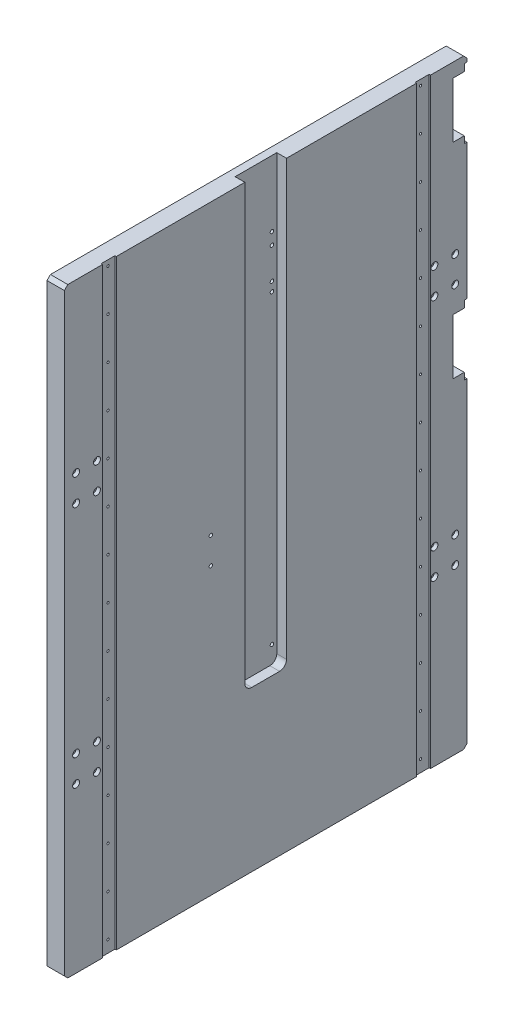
from build123d import *

# Parameters (mm, degrees)
ESQUISSE1_W                                        = 580
ESQUISSE1_H                                        = 865
BOSS_EXTRU_1_DEPTH                                 = 25
ENL_V_MAT_EXTRU_1_DEPTH                            = 14
TROU_TARAUD_M61_D                                  = 5
ESQUISSE17_W                                       = 20
ESQUISSE17_H                                       = 865
ENL_V_MAT_EXTRU_6_DEPTH                            = 2
CHAMBRAGE_POUR_VIS_T_TE_HEXAGONALE_M51_D           = 5.5
CHAMBRAGE_POUR_VIS_T_TE_HEXAGONALE_M51_CBORE_D     = 10
CHAMBRAGE_POUR_VIS_T_TE_HEXAGONALE_M51_CBORE_DEPTH = 5.4
R_P_TITION_LIN_AIRE1_COUNT                         = 2
R_P_TITION_LIN_AIRE1_PITCH                         = 350
TROU_TARAUD_M44_AT_2_COUNT                         = 2
TROU_TARAUD_M44_AT_2_PITCH                         = 450
R_P_TITION_LIN_AIRE2_COUNT                         = 15
R_P_TITION_LIN_AIRE2_PITCH                         = 60
TROU_TARAUD_M62_D                                  = 5
ENL_V_MAT_EXTRU_7_DEPTH                            = 30
TROU_TARAUD_M31_AT_2_COUNT                         = 2
TROU_TARAUD_M31_AT_2_PITCH                         = 35
TROU_TARAUD_M31_AT_3_COUNT                         = 2
TROU_TARAUD_M31_AT_3_PITCH                         = 5
TROU_TARAUD_M31_AT_4_COUNT                         = 2
TROU_TARAUD_M31_AT_4_PITCH                         = 10
TROU_TARAUD_M31_AT_5_COUNT                         = 2
TROU_TARAUD_M31_AT_5_PITCH                         = 40
TROU_TARAUD_M31_AT_6_COUNT                         = 2
TROU_TARAUD_M31_AT_6_PITCH                         = 5
TROU_TARAUD_M31_AT_7_COUNT                         = 2
TROU_TARAUD_M31_AT_7_PITCH                         = 50
TROU_TARAUD_M31_AT_8_COUNT                         = 2
TROU_TARAUD_M31_AT_8_PITCH                         = 45
TROU_TARAUD_M32_AT_2_COUNT                         = 2
TROU_TARAUD_M32_AT_2_PITCH                         = 90
R_P_TITION_LIN_AIRE3_COUNT                         = 2
R_P_TITION_LIN_AIRE3_PITCH                         = 295
CHANFREIN1_SIZE                                    = 5


with BuildPart() as part:
    # Esquisse1 → Boss.-Extru.1 (new body)
    with BuildSketch(Plane(origin=(0, 0, 0), x_dir=(0, 0, -1), z_dir=(1, 0, 0))):
        with Locations((0, 97.5)):
            Rectangle(ESQUISSE1_W, ESQUISSE1_H)
    extrude(amount=-BOSS_EXTRU_1_DEPTH)

    # Esquisse2 → Enl_v. mat.-Extru.1 (cut)
    with BuildSketch(Plane(origin=(0, 0, 0), x_dir=(0, 0, -1), z_dir=(1, 0, 0))):
        with BuildLine():
            Line((-30, 530), (-30, -95))
            ThreePointArc((-30, -95), (-27.071067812, -102.071067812), (-20, -105))
            Line((-20, -105), (20, -105))
            ThreePointArc((20, -105), (27.071067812, -102.071067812), (30, -95))
            Line((30, -95), (30, 530))
            Line((30, 530), (-30, 530))
        make_face()
    extrude(amount=-ENL_V_MAT_EXTRU_1_DEPTH, mode=Mode.SUBTRACT)

    # Trou taraud_ M61 (through all)
    with Locations(Plane(origin=(-14, 0, 0), x_dir=(0, 0, -1), z_dir=(1, 0, 0))):
        with Locations((-23, 373), (-23, 360), (23, 360), (23, 373), (-23, 418), (-23, 435), (23, 435), (23, 418), (-23, -80), (23, -80)):
            Hole(TROU_TARAUD_M61_D / 2)

    # Esquisse17 → Enl_v. mat.-Extru.6 (cut)
    with BuildSketch(Plane.ZY):
        with Locations((-227.5, 97.5)):
            Rectangle(ESQUISSE17_W, ESQUISSE17_H)
        with Locations((225, 97.5)):
            Rectangle(ESQUISSE17_W, ESQUISSE17_H)
    extrude(amount=ENL_V_MAT_EXTRU_6_DEPTH, mode=Mode.SUBTRACT)

    # Chambrage pour vis _ t_te hexagonale M51 (through all)
    with Locations(Plane(origin=(0, 0, 0), x_dir=(0, 0, -1), z_dir=(1, 0, 0))):
        with Locations((-243, 289), (273, 289), (273, 251), (243, 251), (243, 289), (-243, 251), (-273, 251), (-273, 289)):
            chambrage_pour_vis_t_te_hexagonale_m51 = CounterBoreHole(CHAMBRAGE_POUR_VIS_T_TE_HEXAGONALE_M51_D / 2, CHAMBRAGE_POUR_VIS_T_TE_HEXAGONALE_M51_CBORE_D / 2, CHAMBRAGE_POUR_VIS_T_TE_HEXAGONALE_M51_CBORE_DEPTH)

    # R_p_tition lin_aire1: Chambrage pour vis _ t_te hexagonale M51 ×2
    with Locations(*[(0, -i * R_P_TITION_LIN_AIRE1_PITCH, 0) for i in range(1, R_P_TITION_LIN_AIRE1_COUNT)]):
        add(chambrage_pour_vis_t_te_hexagonale_m51, mode=Mode.SUBTRACT)

    # Esquisse27 → Trou taraud_ M44 (revolve, cut)
    with BuildSketch(Plane(origin=(-2, 522, -225), x_dir=(0, 0, -1), z_dir=(0, 1, 0))):
        Polygon((0, 0), (0, 11.091420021), (1.65, 10.1), (1.65, 0), align=None)
    trou_taraud_m44 = revolve(axis=Axis((4.35, 522, -225), (-1, 0, 0)), mode=Mode.SUBTRACT)

    # Trou taraud_ M44 at 2: Trou taraud_ M44 ×2
    with Locations(*[(0, 0, i * TROU_TARAUD_M44_AT_2_PITCH) for i in range(1, TROU_TARAUD_M44_AT_2_COUNT)]):
        add(trou_taraud_m44, mode=Mode.SUBTRACT)

    # R_p_tition lin_aire2: Trou taraud_ M44 ×15
    with Locations(*[(0, -i * R_P_TITION_LIN_AIRE2_PITCH, 0) for i in range(1, R_P_TITION_LIN_AIRE2_COUNT)]):
        add(trou_taraud_m44, mode=Mode.SUBTRACT)

    # R_p_tition lin_aire2 copy 1 sketch → R_p_tition lin_aire2 copy 1 (revolve, cut)
    with BuildSketch(Plane(origin=(-2, 462, 225), x_dir=(0, 0, -1), z_dir=(0, 1, 0))):
        Polygon((0, 0), (0, 11.091420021), (1.65, 10.1), (1.65, 0), align=None)
    revolve(axis=Axis((4.35, 462, 225), (-1, 0, 0)), mode=Mode.SUBTRACT)

    # R_p_tition lin_aire2 copy 2 sketch → R_p_tition lin_aire2 copy 2 (revolve, cut)
    with BuildSketch(Plane(origin=(-2, 402, 225), x_dir=(0, 0, -1), z_dir=(0, 1, 0))):
        Polygon((0, 0), (0, 11.091420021), (1.65, 10.1), (1.65, 0), align=None)
    revolve(axis=Axis((4.35, 402, 225), (-1, 0, 0)), mode=Mode.SUBTRACT)

    # R_p_tition lin_aire2 copy 3 sketch → R_p_tition lin_aire2 copy 3 (revolve, cut)
    with BuildSketch(Plane(origin=(-2, 342, 225), x_dir=(0, 0, -1), z_dir=(0, 1, 0))):
        Polygon((0, 0), (0, 11.091420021), (1.65, 10.1), (1.65, 0), align=None)
    revolve(axis=Axis((4.35, 342, 225), (-1, 0, 0)), mode=Mode.SUBTRACT)

    # R_p_tition lin_aire2 copy 4 sketch → R_p_tition lin_aire2 copy 4 (revolve, cut)
    with BuildSketch(Plane(origin=(-2, 282, 225), x_dir=(0, 0, -1), z_dir=(0, 1, 0))):
        Polygon((0, 0), (0, 11.091420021), (1.65, 10.1), (1.65, 0), align=None)
    revolve(axis=Axis((4.35, 282, 225), (-1, 0, 0)), mode=Mode.SUBTRACT)

    # R_p_tition lin_aire2 copy 5 sketch → R_p_tition lin_aire2 copy 5 (revolve, cut)
    with BuildSketch(Plane(origin=(-2, 222, 225), x_dir=(0, 0, -1), z_dir=(0, 1, 0))):
        Polygon((0, 0), (0, 11.091420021), (1.65, 10.1), (1.65, 0), align=None)
    revolve(axis=Axis((4.35, 222, 225), (-1, 0, 0)), mode=Mode.SUBTRACT)

    # R_p_tition lin_aire2 copy 6 sketch → R_p_tition lin_aire2 copy 6 (revolve, cut)
    with BuildSketch(Plane(origin=(-2, 162, 225), x_dir=(0, 0, -1), z_dir=(0, 1, 0))):
        Polygon((0, 0), (0, 11.091420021), (1.65, 10.1), (1.65, 0), align=None)
    revolve(axis=Axis((4.35, 162, 225), (-1, 0, 0)), mode=Mode.SUBTRACT)

    # R_p_tition lin_aire2 copy 7 sketch → R_p_tition lin_aire2 copy 7 (revolve, cut)
    with BuildSketch(Plane(origin=(-2, 102, 225), x_dir=(0, 0, -1), z_dir=(0, 1, 0))):
        Polygon((0, 0), (0, 11.091420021), (1.65, 10.1), (1.65, 0), align=None)
    revolve(axis=Axis((4.35, 102, 225), (-1, 0, 0)), mode=Mode.SUBTRACT)

    # R_p_tition lin_aire2 copy 8 sketch → R_p_tition lin_aire2 copy 8 (revolve, cut)
    with BuildSketch(Plane(origin=(-2, 42, 225), x_dir=(0, 0, -1), z_dir=(0, 1, 0))):
        Polygon((0, 0), (0, 11.091420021), (1.65, 10.1), (1.65, 0), align=None)
    revolve(axis=Axis((4.35, 42, 225), (-1, 0, 0)), mode=Mode.SUBTRACT)

    # R_p_tition lin_aire2 copy 9 sketch → R_p_tition lin_aire2 copy 9 (revolve, cut)
    with BuildSketch(Plane(origin=(-2, -18, 225), x_dir=(0, 0, -1), z_dir=(0, 1, 0))):
        Polygon((0, 0), (0, 11.091420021), (1.65, 10.1), (1.65, 0), align=None)
    revolve(axis=Axis((4.35, -18, 225), (-1, 0, 0)), mode=Mode.SUBTRACT)

    # R_p_tition lin_aire2 copy 10 sketch → R_p_tition lin_aire2 copy 10 (revolve, cut)
    with BuildSketch(Plane(origin=(-2, -78, 225), x_dir=(0, 0, -1), z_dir=(0, 1, 0))):
        Polygon((0, 0), (0, 11.091420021), (1.65, 10.1), (1.65, 0), align=None)
    revolve(axis=Axis((4.35, -78, 225), (-1, 0, 0)), mode=Mode.SUBTRACT)

    # R_p_tition lin_aire2 copy 11 sketch → R_p_tition lin_aire2 copy 11 (revolve, cut)
    with BuildSketch(Plane(origin=(-2, -138, 225), x_dir=(0, 0, -1), z_dir=(0, 1, 0))):
        Polygon((0, 0), (0, 11.091420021), (1.65, 10.1), (1.65, 0), align=None)
    revolve(axis=Axis((4.35, -138, 225), (-1, 0, 0)), mode=Mode.SUBTRACT)

    # R_p_tition lin_aire2 copy 12 sketch → R_p_tition lin_aire2 copy 12 (revolve, cut)
    with BuildSketch(Plane(origin=(-2, -198, 225), x_dir=(0, 0, -1), z_dir=(0, 1, 0))):
        Polygon((0, 0), (0, 11.091420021), (1.65, 10.1), (1.65, 0), align=None)
    revolve(axis=Axis((4.35, -198, 225), (-1, 0, 0)), mode=Mode.SUBTRACT)

    # R_p_tition lin_aire2 copy 13 sketch → R_p_tition lin_aire2 copy 13 (revolve, cut)
    with BuildSketch(Plane(origin=(-2, -258, 225), x_dir=(0, 0, -1), z_dir=(0, 1, 0))):
        Polygon((0, 0), (0, 11.091420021), (1.65, 10.1), (1.65, 0), align=None)
    revolve(axis=Axis((4.35, -258, 225), (-1, 0, 0)), mode=Mode.SUBTRACT)

    # R_p_tition lin_aire2 copy 14 sketch → R_p_tition lin_aire2 copy 14 (revolve, cut)
    with BuildSketch(Plane(origin=(-2, -318, 225), x_dir=(0, 0, -1), z_dir=(0, 1, 0))):
        Polygon((0, 0), (0, 11.091420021), (1.65, 10.1), (1.65, 0), align=None)
    revolve(axis=Axis((4.35, -318, 225), (-1, 0, 0)), mode=Mode.SUBTRACT)

    # Trou taraud_ M62 (through all)
    with Locations(Plane.ZY.offset(25)):
        with Locations((21, 114), (21, 76), (79, 76), (79, 114)):
            Hole(TROU_TARAUD_M62_D / 2)

    # Esquisse32 → Enl_v. mat.-Extru.7 (cut)
    with BuildSketch(Plane.ZY.offset(25)):
        Polygon((-286, 430), (-270, 430), (-270, 510), (-286, 510), (-286, 520), (-290, 520), (-290, 420), (-286, 420), align=None)
    enl_v_mat_extru_7 = extrude(amount=-ENL_V_MAT_EXTRU_7_DEPTH, mode=Mode.SUBTRACT)

    # Esquisse34 → Trou taraud_ M31 (revolve, cut)
    with BuildSketch(Plane(origin=(-10, 492.5, -270), x_dir=(0, 1, 0), z_dir=(1, 0, 0))):
        Polygon((0, 0), (0, 8.251075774), (1.25, 7.5), (1.25, 0), align=None)
    trou_taraud_m31 = revolve(axis=Axis((-10, 492.5, -276.35), (0, 0, 1)), mode=Mode.SUBTRACT)

    # Trou taraud_ M31 at 2: Trou taraud_ M31 ×2
    with Locations(*[(0, -i * TROU_TARAUD_M31_AT_2_PITCH, 0) for i in range(1, TROU_TARAUD_M31_AT_2_COUNT)]):
        add(trou_taraud_m31, mode=Mode.SUBTRACT)

    # Trou taraud_ M31 at 3: Trou taraud_ M31 ×2
    with Locations(*[(0, -i * TROU_TARAUD_M31_AT_3_PITCH, 0) for i in range(1, TROU_TARAUD_M31_AT_3_COUNT)]):
        add(trou_taraud_m31, mode=Mode.SUBTRACT)

    # Trou taraud_ M31 at 4: Trou taraud_ M31 ×2
    with Locations(*[(0, -i * TROU_TARAUD_M31_AT_4_PITCH, 0) for i in range(1, TROU_TARAUD_M31_AT_4_COUNT)]):
        add(trou_taraud_m31, mode=Mode.SUBTRACT)

    # Trou taraud_ M31 at 5: Trou taraud_ M31 ×2
    with Locations(*[(0, -i * TROU_TARAUD_M31_AT_5_PITCH, 0) for i in range(1, TROU_TARAUD_M31_AT_5_COUNT)]):
        add(trou_taraud_m31, mode=Mode.SUBTRACT)

    # Trou taraud_ M31 at 6: Trou taraud_ M31 ×2
    with Locations(*[(0, i * TROU_TARAUD_M31_AT_6_PITCH, 0) for i in range(1, TROU_TARAUD_M31_AT_6_COUNT)]):
        add(trou_taraud_m31, mode=Mode.SUBTRACT)

    # Trou taraud_ M31 at 7: Trou taraud_ M31 ×2
    with Locations(*[(0, -i * TROU_TARAUD_M31_AT_7_PITCH, 0) for i in range(1, TROU_TARAUD_M31_AT_7_COUNT)]):
        add(trou_taraud_m31, mode=Mode.SUBTRACT)

    # Trou taraud_ M31 at 8: Trou taraud_ M31 ×2
    with Locations(*[(0, -i * TROU_TARAUD_M31_AT_8_PITCH, 0) for i in range(1, TROU_TARAUD_M31_AT_8_COUNT)]):
        add(trou_taraud_m31, mode=Mode.SUBTRACT)

    # Esquisse36 → Trou taraud_ M32 (revolve, cut)
    with BuildSketch(Plane(origin=(-12.5, 515, -286), x_dir=(0, 1, 0), z_dir=(1, 0, 0))):
        Polygon((0, 0), (0, 8.251075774), (1.25, 7.5), (1.25, 0), align=None)
    trou_taraud_m32 = revolve(axis=Axis((-12.5, 515, -292.35), (0, 0, 1)), mode=Mode.SUBTRACT)

    # Trou taraud_ M32 at 2: Trou taraud_ M32 ×2
    with Locations(*[(0, -i * TROU_TARAUD_M32_AT_2_PITCH, 0) for i in range(1, TROU_TARAUD_M32_AT_2_COUNT)]):
        add(trou_taraud_m32, mode=Mode.SUBTRACT)

    # R_p_tition lin_aire3: Enl_v. mat.-Extru.7, Trou taraud_ M31, Trou taraud_ M32 ×2
    with Locations(*[(0, -i * R_P_TITION_LIN_AIRE3_PITCH, 0) for i in range(1, R_P_TITION_LIN_AIRE3_COUNT)]):
        add(enl_v_mat_extru_7, mode=Mode.SUBTRACT)
        add(trou_taraud_m31, mode=Mode.SUBTRACT)
        add(trou_taraud_m32, mode=Mode.SUBTRACT)

    # R_p_tition lin_aire3 copy 1 sketch → R_p_tition lin_aire3 copy 1 (revolve, cut)
    with BuildSketch(Plane(origin=(-10, 162.5, -270), x_dir=(0, 1, 0), z_dir=(1, 0, 0))):
        Polygon((0, 0), (0, 8.251075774), (1.25, 7.5), (1.25, 0), align=None)
    revolve(axis=Axis((-10, 162.5, -276.35), (0, 0, 1)), mode=Mode.SUBTRACT)

    # R_p_tition lin_aire3 copy 2 sketch → R_p_tition lin_aire3 copy 2 (revolve, cut)
    with BuildSketch(Plane(origin=(-10, 192.5, -270), x_dir=(0, 1, 0), z_dir=(1, 0, 0))):
        Polygon((0, 0), (0, 8.251075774), (1.25, 7.5), (1.25, 0), align=None)
    revolve(axis=Axis((-10, 192.5, -276.35), (0, 0, 1)), mode=Mode.SUBTRACT)

    # R_p_tition lin_aire3 copy 3 sketch → R_p_tition lin_aire3 copy 3 (revolve, cut)
    with BuildSketch(Plane(origin=(-10, 187.5, -270), x_dir=(0, 1, 0), z_dir=(1, 0, 0))):
        Polygon((0, 0), (0, 8.251075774), (1.25, 7.5), (1.25, 0), align=None)
    revolve(axis=Axis((-10, 187.5, -276.35), (0, 0, 1)), mode=Mode.SUBTRACT)

    # R_p_tition lin_aire3 copy 4 sketch → R_p_tition lin_aire3 copy 4 (revolve, cut)
    with BuildSketch(Plane(origin=(-10, 157.5, -270), x_dir=(0, 1, 0), z_dir=(1, 0, 0))):
        Polygon((0, 0), (0, 8.251075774), (1.25, 7.5), (1.25, 0), align=None)
    revolve(axis=Axis((-10, 157.5, -276.35), (0, 0, 1)), mode=Mode.SUBTRACT)

    # R_p_tition lin_aire3 copy 5 sketch → R_p_tition lin_aire3 copy 5 (revolve, cut)
    with BuildSketch(Plane(origin=(-10, 202.5, -270), x_dir=(0, 1, 0), z_dir=(1, 0, 0))):
        Polygon((0, 0), (0, 8.251075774), (1.25, 7.5), (1.25, 0), align=None)
    revolve(axis=Axis((-10, 202.5, -276.35), (0, 0, 1)), mode=Mode.SUBTRACT)

    # R_p_tition lin_aire3 copy 6 sketch → R_p_tition lin_aire3 copy 6 (revolve, cut)
    with BuildSketch(Plane(origin=(-10, 147.5, -270), x_dir=(0, 1, 0), z_dir=(1, 0, 0))):
        Polygon((0, 0), (0, 8.251075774), (1.25, 7.5), (1.25, 0), align=None)
    revolve(axis=Axis((-10, 147.5, -276.35), (0, 0, 1)), mode=Mode.SUBTRACT)

    # R_p_tition lin_aire3 copy 7 sketch → R_p_tition lin_aire3 copy 7 (revolve, cut)
    with BuildSketch(Plane(origin=(-10, 152.5, -270), x_dir=(0, 1, 0), z_dir=(1, 0, 0))):
        Polygon((0, 0), (0, 8.251075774), (1.25, 7.5), (1.25, 0), align=None)
    revolve(axis=Axis((-10, 152.5, -276.35), (0, 0, 1)), mode=Mode.SUBTRACT)

    # R_p_tition lin_aire3 copy 8 sketch → R_p_tition lin_aire3 copy 8 (revolve, cut)
    with BuildSketch(Plane(origin=(-12.5, 130, -286), x_dir=(0, 1, 0), z_dir=(1, 0, 0))):
        Polygon((0, 0), (0, 8.251075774), (1.25, 7.5), (1.25, 0), align=None)
    revolve(axis=Axis((-12.5, 130, -292.35), (0, 0, 1)), mode=Mode.SUBTRACT)

    # Chanfrein1
    chanfrein1_edges = [part.edges().sort_by_distance(p)[0] for p in [
        (-12.5, 530, -290),
        (-12.5, -335, -290),
        (-12.5, -335, 290),
        (-12.5, 530, 290),
    ]]
    chamfer(chanfrein1_edges, length=CHANFREIN1_SIZE)


solid = part.part
